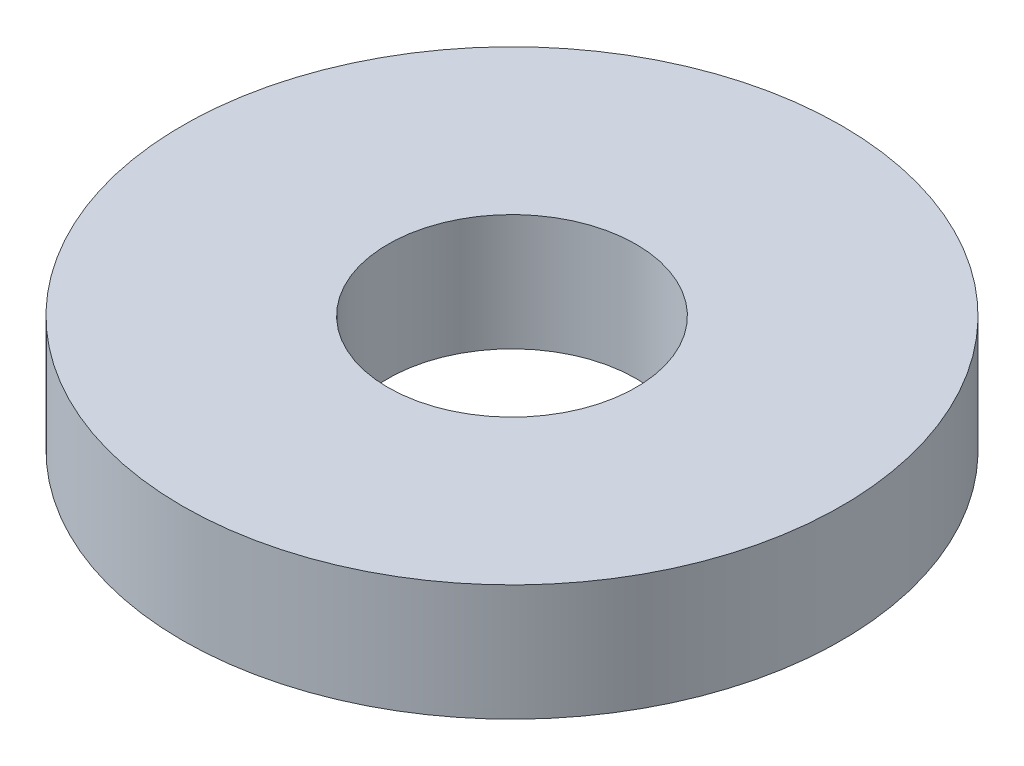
from build123d import *

# Parameters (mm, degrees)
SKIZZE1_R                       = 8.5
SKIZZE1_R_2                     = 3.2
AUFSATZ_LINEAR_AUSTRAGEN1_DEPTH = 3


with BuildPart() as part:
    # Skizze1 → Aufsatz-Linear austragen1 (new body)
    with BuildSketch(Plane(origin=(0, 0, 0), x_dir=(1, 0, 0), z_dir=(0, 1, 0))):
        with Locations(Location((0, 0, 0), (0, 0, 270))):
            Circle(SKIZZE1_R)
        with Locations(Location((0, 0, 0), (0, 0, 270))):
            Circle(SKIZZE1_R_2, mode=Mode.SUBTRACT)
    extrude(amount=AUFSATZ_LINEAR_AUSTRAGEN1_DEPTH)


solid = part.part
